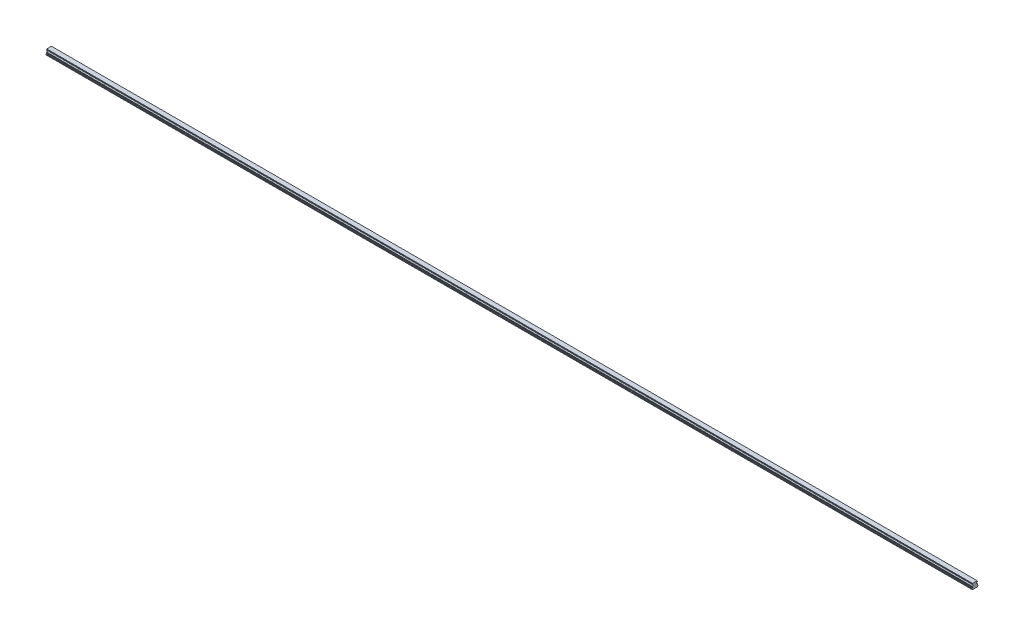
from build123d import *

# Parameters (mm, degrees)
BOSS_EXTRUDE1_DEPTH        = 3720
SKETCH3_R                  = 3
SKETCH3_R_2                = 2.5
CUT_EXTRUDE3_DEPTH         = 12
SKETCH3_2_R                = 2.5
CUT_EXTRUDE4_DEPTH         = 15
CHAMFER1_SIZE              = 0.5
LPATTERN4_COUNT            = 62
LPATTERN4_PITCH            = 60
CHAMFER1_OF_LPATTERN4_SIZE = 0.5


with BuildPart() as part:
    # Sketch1 → Boss-Extrude1 (new body)
    with BuildSketch(Plane(origin=(0, 0, 0), x_dir=(0, 0, -1), z_dir=(1, 0, 0))):
        with BuildLine():
            Line((9.375, 21.8), (-9.375, 21.8))
            Line((-9.375, 21.8), (-9.375, 20.756))
            Line((-9.375, 20.756), (-10, 19.415683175))
            Line((-10, 19.415683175), (-10, 17.685449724))
            ThreePointArc((-10, 17.685449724), (-7.2, 14.6), (-10, 11.514550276))
            Line((-10, 11.514550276), (-10, 9.784316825))
            Line((-10, 9.784316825), (-9.375, 8.444))
            Line((-9.375, 8.444), (-9.922688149, 6.4))
            Line((-9.922688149, 6.4), (-12.5, 5.489338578))
            Line((-12.5, 5.489338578), (-12.5, 2.65))
            Line((-12.5, 2.65), (-9.85, 0))
            Line((-9.85, 0), (-5.5, 0))
            Line((-5.5, 0), (-5, 0.5))
            Line((-5, 0.5), (5, 0.5))
            Line((5, 0.5), (5.5, 0))
            Line((5.5, 0), (9.85, 0))
            Line((9.85, 0), (12.5, 2.65))
            Line((12.5, 2.65), (12.5, 5.489338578))
            Line((12.5, 5.489338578), (9.922688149, 6.4))
            Line((9.922688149, 6.4), (9.375, 8.444))
            Line((9.375, 8.444), (10, 9.784316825))
            Line((10, 9.784316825), (10, 11.514550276))
            ThreePointArc((10, 11.514550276), (7.2, 14.6), (10, 17.685449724))
            Line((10, 17.685449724), (10, 19.415683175))
            Line((10, 19.415683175), (9.375, 20.756))
            Line((9.375, 20.756), (9.375, 21.8))
        make_face()
    extrude(amount=BOSS_EXTRUDE1_DEPTH)

    # Sketch3 → Cut-Extrude3 (cut)
    with BuildSketch(Plane.XZ):
        with Locations(Location((30, 0, 0), (0, 0, 270))):
            Circle(SKETCH3_R)
        with Locations(Location((30, 0, 0), (0, 0, 270))):
            Circle(SKETCH3_R_2, mode=Mode.SUBTRACT)
    cut_extrude3 = extrude(amount=-CUT_EXTRUDE3_DEPTH, mode=Mode.SUBTRACT)

    # Sketch3_2 → Cut-Extrude4 (cut)
    with BuildSketch(Plane.XZ):
        with Locations(Location((30, 0, 0), (0, 0, 270))):
            Circle(SKETCH3_2_R)
    cut_extrude4 = extrude(amount=-CUT_EXTRUDE4_DEPTH, mode=Mode.SUBTRACT)

    # Cut-Extrude5 cone 1 section (on through the dimple's axis) → Cut-Extrude5 (revolve, cut)
    with BuildSketch(Plane(origin=(30, 15, 0), x_dir=(0, 0, -1), z_dir=(1, 0, 0))):
        Polygon((0, 0), (2.5, 0), (0, 1.443375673), align=None)
    cut_extrude5 = revolve(axis=Axis((30, 15, 0), (0, 1, 0)), mode=Mode.SUBTRACT)

    # Chamfer1
    chamfer1_edges = [part.edges().sort_by_distance(p)[0] for p in [
        (30, 0.5, 3),
    ]]
    chamfer(chamfer1_edges, length=CHAMFER1_SIZE)

    # LPattern4: Cut-Extrude3, Cut-Extrude4, Cut-Extrude5 ×62
    with Locations(*[(i * LPATTERN4_PITCH, 0, 0) for i in range(1, LPATTERN4_COUNT)]):
        add(cut_extrude3, mode=Mode.SUBTRACT)
        add(cut_extrude4, mode=Mode.SUBTRACT)
        add(cut_extrude5, mode=Mode.SUBTRACT)

    # Chamfer1 of LPattern4
    chamfer1_of_lpattern4_edges = [part.edges().sort_by_distance(p)[0] for p in [
        (90, 0.5, 3),
        (150, 0.5, 3),
        (210, 0.5, 3),
        (270, 0.5, 3),
        (330, 0.5, 3),
        (390, 0.5, 3),
        (450, 0.5, 3),
        (510, 0.5, 3),
        (570, 0.5, 3),
        (630, 0.5, 3),
        (690, 0.5, 3),
        (750, 0.5, 3),
        (810, 0.5, 3),
        (870, 0.5, 3),
        (930, 0.5, 3),
        (990, 0.5, 3),
        (1050, 0.5, 3),
        (1110, 0.5, 3),
        (1170, 0.5, 3),
        (1230, 0.5, 3),
        (1290, 0.5, 3),
        (1350, 0.5, 3),
        (1410, 0.5, 3),
        (1470, 0.5, 3),
        (1530, 0.5, 3),
        (1590, 0.5, 3),
        (1650, 0.5, 3),
        (1710, 0.5, 3),
        (1770, 0.5, 3),
        (1830, 0.5, 3),
        (1890, 0.5, 3),
        (1950, 0.5, 3),
        (2010, 0.5, 3),
        (2070, 0.5, 3),
        (2130, 0.5, 3),
        (2190, 0.5, 3),
        (2250, 0.5, 3),
        (2310, 0.5, 3),
        (2370, 0.5, 3),
        (2430, 0.5, 3),
        (2490, 0.5, 3),
        (2550, 0.5, 3),
        (2610, 0.5, 3),
        (2670, 0.5, 3),
        (2730, 0.5, 3),
        (2790, 0.5, 3),
        (2850, 0.5, 3),
        (2910, 0.5, 3),
        (2970, 0.5, 3),
        (3030, 0.5, 3),
        (3090, 0.5, 3),
        (3150, 0.5, 3),
        (3210, 0.5, 3),
        (3270, 0.5, 3),
        (3330, 0.5, 3),
        (3390, 0.5, 3),
        (3450, 0.5, 3),
        (3510, 0.5, 3),
        (3570, 0.5, 3),
        (3630, 0.5, 3),
        (3690, 0.5, 3),
    ]]
    chamfer(chamfer1_of_lpattern4_edges, length=CHAMFER1_OF_LPATTERN4_SIZE)


solid = part.part
